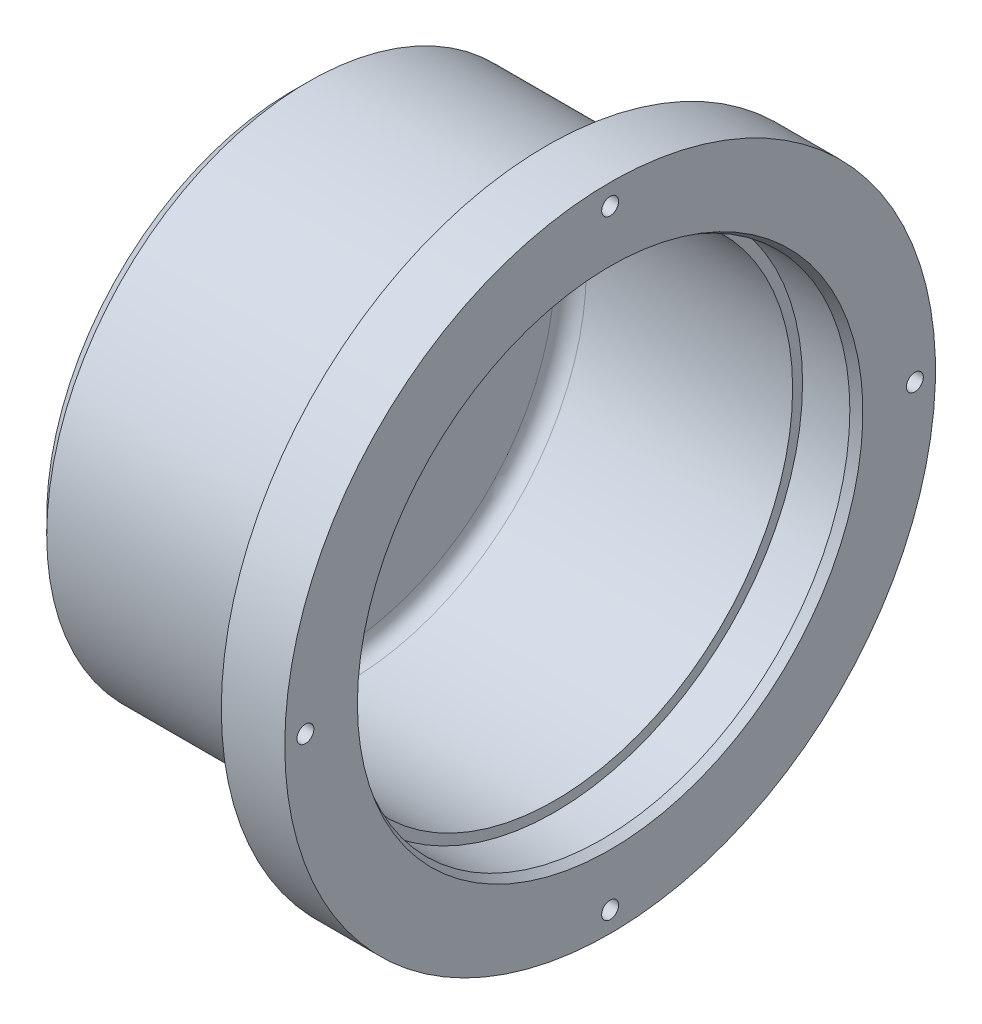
ISO-10303-21;
HEADER;
FILE_DESCRIPTION(('STEP AP214'),'2;1');
FILE_NAME('part.step','',(''),(''),'','','');
FILE_SCHEMA(('AUTOMOTIVE_DESIGN { 1 0 10303 214 1 1 1 1 }'));
ENDSEC;
DATA;
#1=APPLICATION_CONTEXT('core data for automotive mechanical design processes');
#2=APPLICATION_PROTOCOL_DEFINITION('international standard','automotive_design',2000,#1);
#3=PRODUCT_CONTEXT('',#1,'mechanical');
#4=PRODUCT('Part','Part','',(#3));
#5=PRODUCT_RELATED_PRODUCT_CATEGORY('part','',(#4));
#6=PRODUCT_DEFINITION_FORMATION('','',#4);
#7=PRODUCT_DEFINITION_CONTEXT('part definition',#1,'design');
#8=PRODUCT_DEFINITION('design','',#6,#7);
#9=PRODUCT_DEFINITION_SHAPE('','',#8);
#10=(LENGTH_UNIT() NAMED_UNIT(*) SI_UNIT(.MILLI.,.METRE.));
#11=(NAMED_UNIT(*) PLANE_ANGLE_UNIT() SI_UNIT($,.RADIAN.));
#12=(NAMED_UNIT(*) SI_UNIT($,.STERADIAN.) SOLID_ANGLE_UNIT());
#13=UNCERTAINTY_MEASURE_WITH_UNIT(LENGTH_MEASURE(1.E-05),#10,'distance_accuracy_value','');
#14=(GEOMETRIC_REPRESENTATION_CONTEXT(3) GLOBAL_UNCERTAINTY_ASSIGNED_CONTEXT((#13)) GLOBAL_UNIT_ASSIGNED_CONTEXT((#10,
#11,#12)) REPRESENTATION_CONTEXT('',''));
#15=CARTESIAN_POINT('',(0.,0.,0.));
#16=DIRECTION('',(0.,0.,1.));
#17=DIRECTION('',(1.,0.,0.));
#18=AXIS2_PLACEMENT_3D('',#15,#16,#17);
#19=CARTESIAN_POINT('',(-50.8,0.,0.));
#20=DIRECTION('',(-1.,0.,0.));
#21=DIRECTION('',(0.,0.,1.));
#22=AXIS2_PLACEMENT_3D('',#19,#20,#21);
#23=CYLINDRICAL_SURFACE('',#22,39.6875);
#24=CARTESIAN_POINT('',(-1.31982271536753,0.,0.));
#25=DIRECTION('',(-1.,0.,0.));
#26=DIRECTION('',(0.,0.,1.));
#27=AXIS2_PLACEMENT_3D('',#24,#25,#26);
#28=CIRCLE('',#27,39.6875);
#29=CARTESIAN_POINT('',(-1.31982271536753,0.,39.6875));
#30=VERTEX_POINT('',#29);
#31=EDGE_CURVE('E50',#30,#30,#28,.F.);
#32=ORIENTED_EDGE('',*,*,#31,.T.);
#33=EDGE_LOOP('',(#32));
#34=FACE_BOUND('',#33,.T.);
#35=CARTESIAN_POINT('',(-8.89000000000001,0.,0.));
#36=DIRECTION('',(-1.,0.,0.));
#37=DIRECTION('',(0.,0.,1.));
#38=AXIS2_PLACEMENT_3D('',#35,#36,#37);
#39=CIRCLE('',#38,39.6875);
#40=CARTESIAN_POINT('',(-8.89000000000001,0.,39.6875));
#41=VERTEX_POINT('',#40);
#42=EDGE_CURVE('E71',#41,#41,#39,.T.);
#43=ORIENTED_EDGE('',*,*,#42,.T.);
#44=EDGE_LOOP('',(#43));
#45=FACE_BOUND('',#44,.T.);
#46=ADVANCED_FACE('F31',(#34,#45),#23,.F.);
#47=CARTESIAN_POINT('',(0.,-31.4549673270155,0.));
#48=DIRECTION('',(-1.,0.,0.));
#49=DIRECTION('',(0.,0.,1.));
#50=AXIS2_PLACEMENT_3D('',#47,#48,#49);
#51=PLANE('',#50);
#52=CARTESIAN_POINT('',(0.,5.10817981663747E-13,48.768));
#53=DIRECTION('',(1.,0.,0.));
#54=DIRECTION('',(0.,0.,-1.));
#55=AXIS2_PLACEMENT_3D('',#52,#53,#54);
#56=CIRCLE('',#55,1.35254999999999);
#57=CARTESIAN_POINT('',(0.,5.10817981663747E-13,47.41545));
#58=VERTEX_POINT('',#57);
#59=EDGE_CURVE('E55',#58,#58,#56,.T.);
#60=ORIENTED_EDGE('',*,*,#59,.F.);
#61=EDGE_LOOP('',(#60));
#62=FACE_BOUND('',#61,.T.);
#63=CARTESIAN_POINT('',(0.,-48.768,3.40545321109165E-13));
#64=DIRECTION('',(1.,0.,0.));
#65=DIRECTION('',(0.,0.,-1.));
#66=AXIS2_PLACEMENT_3D('',#63,#64,#65);
#67=CIRCLE('',#66,1.35254999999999);
#68=CARTESIAN_POINT('',(0.,-48.768,-1.35254999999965));
#69=VERTEX_POINT('',#68);
#70=EDGE_CURVE('E54',#69,#69,#67,.T.);
#71=ORIENTED_EDGE('',*,*,#70,.F.);
#72=EDGE_LOOP('',(#71));
#73=FACE_BOUND('',#72,.T.);
#74=CARTESIAN_POINT('',(0.,-1.70272660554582E-13,-48.768));
#75=DIRECTION('',(1.,0.,0.));
#76=DIRECTION('',(0.,0.,-1.));
#77=AXIS2_PLACEMENT_3D('',#74,#75,#76);
#78=CIRCLE('',#77,1.35254999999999);
#79=CARTESIAN_POINT('',(0.,-1.70272660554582E-13,-50.12055));
#80=VERTEX_POINT('',#79);
#81=EDGE_CURVE('E59',#80,#80,#78,.T.);
#82=ORIENTED_EDGE('',*,*,#81,.F.);
#83=EDGE_LOOP('',(#82));
#84=FACE_BOUND('',#83,.T.);
#85=CARTESIAN_POINT('',(0.,48.768,0.));
#86=DIRECTION('',(1.,0.,0.));
#87=DIRECTION('',(0.,0.,-1.));
#88=AXIS2_PLACEMENT_3D('',#85,#86,#87);
#89=CIRCLE('',#88,1.35254999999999);
#90=CARTESIAN_POINT('',(0.,48.768,-1.35254999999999));
#91=VERTEX_POINT('',#90);
#92=EDGE_CURVE('E63',#91,#91,#89,.T.);
#93=ORIENTED_EDGE('',*,*,#92,.F.);
#94=EDGE_LOOP('',(#93));
#95=FACE_BOUND('',#94,.T.);
#96=CARTESIAN_POINT('',(0.,0.,0.));
#97=DIRECTION('',(-1.,0.,0.));
#98=DIRECTION('',(0.,0.,1.));
#99=AXIS2_PLACEMENT_3D('',#96,#97,#98);
#100=CIRCLE('',#99,40.4495);
#101=CARTESIAN_POINT('',(0.,0.,40.4495));
#102=VERTEX_POINT('',#101);
#103=EDGE_CURVE('E74',#102,#102,#100,.T.);
#104=ORIENTED_EDGE('',*,*,#103,.T.);
#105=EDGE_LOOP('',(#104));
#106=FACE_BOUND('',#105,.T.);
#107=CARTESIAN_POINT('',(0.,0.,0.));
#108=DIRECTION('',(-1.,0.,0.));
#109=DIRECTION('',(0.,0.,1.));
#110=AXIS2_PLACEMENT_3D('',#107,#108,#109);
#111=CIRCLE('',#110,52.07);
#112=CARTESIAN_POINT('',(0.,0.,52.07));
#113=VERTEX_POINT('',#112);
#114=EDGE_CURVE('E83',#113,#113,#111,.T.);
#115=ORIENTED_EDGE('',*,*,#114,.F.);
#116=EDGE_LOOP('',(#115));
#117=FACE_BOUND('',#116,.T.);
#118=ADVANCED_FACE('F108',(#62,#73,#84,#95,#106,#117),#51,.F.);
#119=CARTESIAN_POINT('',(-50.8,0.,0.));
#120=DIRECTION('',(-1.,0.,0.));
#121=DIRECTION('',(0.,0.,1.));
#122=AXIS2_PLACEMENT_3D('',#119,#120,#121);
#123=CYLINDRICAL_SURFACE('',#122,52.07);
#124=CARTESIAN_POINT('',(-10.16,0.,0.));
#125=DIRECTION('',(-1.,0.,0.));
#126=DIRECTION('',(0.,0.,1.));
#127=AXIS2_PLACEMENT_3D('',#124,#125,#126);
#128=CIRCLE('',#127,52.07);
#129=CARTESIAN_POINT('',(-10.16,0.,52.07));
#130=VERTEX_POINT('',#129);
#131=EDGE_CURVE('E86',#130,#130,#128,.T.);
#132=ORIENTED_EDGE('',*,*,#131,.F.);
#133=EDGE_LOOP('',(#132));
#134=FACE_BOUND('',#133,.T.);
#135=ORIENTED_EDGE('',*,*,#114,.T.);
#136=EDGE_LOOP('',(#135));
#137=FACE_BOUND('',#136,.T.);
#138=ADVANCED_FACE('F111',(#134,#137),#123,.T.);
#139=CARTESIAN_POINT('',(-10.16,-31.4549673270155,0.));
#140=DIRECTION('',(1.,0.,0.));
#141=DIRECTION('',(0.,0.,-1.));
#142=AXIS2_PLACEMENT_3D('',#139,#140,#141);
#143=PLANE('',#142);
#144=CARTESIAN_POINT('',(-10.16,0.,0.));
#145=DIRECTION('',(1.,0.,0.));
#146=DIRECTION('',(0.,0.,-1.));
#147=AXIS2_PLACEMENT_3D('',#144,#145,#146);
#148=CIRCLE('',#147,43.18);
#149=CARTESIAN_POINT('',(-10.16,0.,-43.18));
#150=VERTEX_POINT('',#149);
#151=EDGE_CURVE('E41',#150,#150,#148,.T.);
#152=ORIENTED_EDGE('',*,*,#151,.T.);
#153=EDGE_LOOP('',(#152));
#154=FACE_BOUND('',#153,.T.);
#155=CARTESIAN_POINT('',(-10.16,5.10817981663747E-13,48.768));
#156=DIRECTION('',(1.,0.,0.));
#157=DIRECTION('',(0.,0.,-1.));
#158=AXIS2_PLACEMENT_3D('',#155,#156,#157);
#159=CIRCLE('',#158,1.35254999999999);
#160=CARTESIAN_POINT('',(-10.16,5.10817981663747E-13,47.41545));
#161=VERTEX_POINT('',#160);
#162=EDGE_CURVE('E51',#161,#161,#159,.T.);
#163=ORIENTED_EDGE('',*,*,#162,.T.);
#164=EDGE_LOOP('',(#163));
#165=FACE_BOUND('',#164,.T.);
#166=CARTESIAN_POINT('',(-10.16,-48.768,3.40545321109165E-13));
#167=DIRECTION('',(1.,0.,0.));
#168=DIRECTION('',(0.,0.,-1.));
#169=AXIS2_PLACEMENT_3D('',#166,#167,#168);
#170=CIRCLE('',#169,1.35254999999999);
#171=CARTESIAN_POINT('',(-10.16,-48.768,-1.35254999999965));
#172=VERTEX_POINT('',#171);
#173=EDGE_CURVE('E56',#172,#172,#170,.T.);
#174=ORIENTED_EDGE('',*,*,#173,.T.);
#175=EDGE_LOOP('',(#174));
#176=FACE_BOUND('',#175,.T.);
#177=CARTESIAN_POINT('',(-10.16,-1.70272660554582E-13,-48.768));
#178=DIRECTION('',(1.,0.,0.));
#179=DIRECTION('',(0.,0.,-1.));
#180=AXIS2_PLACEMENT_3D('',#177,#178,#179);
#181=CIRCLE('',#180,1.35254999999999);
#182=CARTESIAN_POINT('',(-10.16,-1.70272660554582E-13,-50.12055));
#183=VERTEX_POINT('',#182);
#184=EDGE_CURVE('E60',#183,#183,#181,.T.);
#185=ORIENTED_EDGE('',*,*,#184,.T.);
#186=EDGE_LOOP('',(#185));
#187=FACE_BOUND('',#186,.T.);
#188=CARTESIAN_POINT('',(-10.16,48.768,0.));
#189=DIRECTION('',(1.,0.,0.));
#190=DIRECTION('',(0.,0.,-1.));
#191=AXIS2_PLACEMENT_3D('',#188,#189,#190);
#192=CIRCLE('',#191,1.35254999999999);
#193=CARTESIAN_POINT('',(-10.16,48.768,-1.35254999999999));
#194=VERTEX_POINT('',#193);
#195=EDGE_CURVE('E64',#194,#194,#192,.T.);
#196=ORIENTED_EDGE('',*,*,#195,.T.);
#197=EDGE_LOOP('',(#196));
#198=FACE_BOUND('',#197,.T.);
#199=ORIENTED_EDGE('',*,*,#131,.T.);
#200=EDGE_LOOP('',(#199));
#201=FACE_BOUND('',#200,.T.);
#202=ADVANCED_FACE('F123',(#154,#165,#176,#187,#198,#201),#143,.F.);
#203=CARTESIAN_POINT('',(-50.8,0.,0.));
#204=DIRECTION('',(-1.,0.,0.));
#205=DIRECTION('',(0.,0.,1.));
#206=AXIS2_PLACEMENT_3D('',#203,#204,#205);
#207=CYLINDRICAL_SURFACE('',#206,41.91);
#208=CARTESIAN_POINT('',(-11.43,0.,0.));
#209=DIRECTION('',(1.,0.,0.));
#210=DIRECTION('',(0.,0.,-1.));
#211=AXIS2_PLACEMENT_3D('',#208,#209,#210);
#212=CIRCLE('',#211,41.91);
#213=CARTESIAN_POINT('',(-11.43,0.,-41.91));
#214=VERTEX_POINT('',#213);
#215=EDGE_CURVE('E45',#214,#214,#212,.F.);
#216=ORIENTED_EDGE('',*,*,#215,.T.);
#217=EDGE_LOOP('',(#216));
#218=FACE_BOUND('',#217,.T.);
#219=CARTESIAN_POINT('',(-48.26,0.,0.));
#220=DIRECTION('',(1.,0.,0.));
#221=DIRECTION('',(0.,0.,-1.));
#222=AXIS2_PLACEMENT_3D('',#219,#220,#221);
#223=CIRCLE('',#222,41.91);
#224=CARTESIAN_POINT('',(-48.26,0.,-41.91));
#225=VERTEX_POINT('',#224);
#226=EDGE_CURVE('E77',#225,#225,#223,.T.);
#227=ORIENTED_EDGE('',*,*,#226,.T.);
#228=EDGE_LOOP('',(#227));
#229=FACE_BOUND('',#228,.T.);
#230=ADVANCED_FACE('F129',(#218,#229),#207,.T.);
#231=CARTESIAN_POINT('',(-50.8,-31.4549673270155,0.));
#232=DIRECTION('',(1.,0.,0.));
#233=DIRECTION('',(0.,0.,-1.));
#234=AXIS2_PLACEMENT_3D('',#231,#232,#233);
#235=PLANE('',#234);
#236=CARTESIAN_POINT('',(-50.8,0.,0.));
#237=DIRECTION('',(-1.,0.,0.));
#238=DIRECTION('',(0.,0.,1.));
#239=AXIS2_PLACEMENT_3D('',#236,#237,#238);
#240=CIRCLE('',#239,9.8827971);
#241=CARTESIAN_POINT('',(-50.8,0.,9.8827971));
#242=VERTEX_POINT('',#241);
#243=EDGE_CURVE('E67',#242,#242,#240,.T.);
#244=ORIENTED_EDGE('',*,*,#243,.F.);
#245=EDGE_LOOP('',(#244));
#246=FACE_BOUND('',#245,.T.);
#247=CARTESIAN_POINT('',(-50.8,0.,0.));
#248=DIRECTION('',(1.,0.,0.));
#249=DIRECTION('',(0.,0.,-1.));
#250=AXIS2_PLACEMENT_3D('',#247,#248,#249);
#251=CIRCLE('',#250,39.37);
#252=CARTESIAN_POINT('',(-50.8,0.,-39.37));
#253=VERTEX_POINT('',#252);
#254=EDGE_CURVE('E80',#253,#253,#251,.F.);
#255=ORIENTED_EDGE('',*,*,#254,.T.);
#256=EDGE_LOOP('',(#255));
#257=FACE_BOUND('',#256,.T.);
#258=ADVANCED_FACE('F155',(#246,#257),#235,.F.);
#259=CARTESIAN_POINT('',(-44.45,-31.4549673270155,0.));
#260=DIRECTION('',(-1.,0.,0.));
#261=DIRECTION('',(0.,0.,1.));
#262=AXIS2_PLACEMENT_3D('',#259,#260,#261);
#263=PLANE('',#262);
#264=CARTESIAN_POINT('',(-44.45,0.,0.));
#265=DIRECTION('',(-1.,0.,0.));
#266=DIRECTION('',(0.,0.,1.));
#267=AXIS2_PLACEMENT_3D('',#264,#265,#266);
#268=CIRCLE('',#267,35.56);
#269=CARTESIAN_POINT('',(-44.45,0.,35.56));
#270=VERTEX_POINT('',#269);
#271=EDGE_CURVE('E10',#270,#270,#268,.F.);
#272=ORIENTED_EDGE('',*,*,#271,.T.);
#273=EDGE_LOOP('',(#272));
#274=FACE_BOUND('',#273,.T.);
#275=CARTESIAN_POINT('',(-44.45,0.,0.));
#276=DIRECTION('',(-1.,0.,0.));
#277=DIRECTION('',(0.,0.,1.));
#278=AXIS2_PLACEMENT_3D('',#275,#276,#277);
#279=CIRCLE('',#278,9.69266959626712);
#280=CARTESIAN_POINT('',(-44.45,0.,9.69266959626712));
#281=VERTEX_POINT('',#280);
#282=EDGE_CURVE('E68',#281,#281,#279,.T.);
#283=ORIENTED_EDGE('',*,*,#282,.T.);
#284=EDGE_LOOP('',(#283));
#285=FACE_BOUND('',#284,.T.);
#286=ADVANCED_FACE('F150',(#274,#285),#263,.F.);
#287=CARTESIAN_POINT('',(-50.8,0.,0.));
#288=DIRECTION('',(-1.,0.,0.));
#289=DIRECTION('',(0.,0.,1.));
#290=AXIS2_PLACEMENT_3D('',#287,#288,#289);
#291=CYLINDRICAL_SURFACE('',#290,38.1);
#292=CARTESIAN_POINT('',(-41.91,0.,0.));
#293=DIRECTION('',(-1.,0.,0.));
#294=DIRECTION('',(0.,0.,1.));
#295=AXIS2_PLACEMENT_3D('',#292,#293,#294);
#296=CIRCLE('',#295,38.1);
#297=CARTESIAN_POINT('',(-41.91,0.,38.1));
#298=VERTEX_POINT('',#297);
#299=EDGE_CURVE('E37',#298,#298,#296,.T.);
#300=ORIENTED_EDGE('',*,*,#299,.T.);
#301=EDGE_LOOP('',(#300));
#302=FACE_BOUND('',#301,.T.);
#303=CARTESIAN_POINT('',(-8.89000000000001,0.,0.));
#304=DIRECTION('',(-1.,0.,0.));
#305=DIRECTION('',(0.,0.,1.));
#306=AXIS2_PLACEMENT_3D('',#303,#304,#305);
#307=CIRCLE('',#306,38.1);
#308=CARTESIAN_POINT('',(-8.89000000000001,0.,38.1));
#309=VERTEX_POINT('',#308);
#310=EDGE_CURVE('E89',#309,#309,#307,.T.);
#311=ORIENTED_EDGE('',*,*,#310,.F.);
#312=EDGE_LOOP('',(#311));
#313=FACE_BOUND('',#312,.T.);
#314=ADVANCED_FACE('F145',(#302,#313),#291,.F.);
#315=CARTESIAN_POINT('',(-8.89000000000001,-31.4549673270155,0.));
#316=DIRECTION('',(-1.,0.,0.));
#317=DIRECTION('',(0.,0.,1.));
#318=AXIS2_PLACEMENT_3D('',#315,#316,#317);
#319=PLANE('',#318);
#320=ORIENTED_EDGE('',*,*,#42,.F.);
#321=EDGE_LOOP('',(#320));
#322=FACE_BOUND('',#321,.T.);
#323=ORIENTED_EDGE('',*,*,#310,.T.);
#324=EDGE_LOOP('',(#323));
#325=FACE_BOUND('',#324,.T.);
#326=ADVANCED_FACE('F141',(#322,#325),#319,.F.);
#327=CARTESIAN_POINT('',(-50.8,0.,0.));
#328=DIRECTION('',(1.,0.,0.));
#329=DIRECTION('',(0.,0.,-1.));
#330=AXIS2_PLACEMENT_3D('',#327,#328,#329);
#331=CONICAL_SURFACE('',#330,39.37,0.785398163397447);
#332=ORIENTED_EDGE('',*,*,#226,.F.);
#333=EDGE_LOOP('',(#332));
#334=FACE_BOUND('',#333,.T.);
#335=ORIENTED_EDGE('',*,*,#254,.F.);
#336=EDGE_LOOP('',(#335));
#337=FACE_BOUND('',#336,.T.);
#338=ADVANCED_FACE('F144',(#334,#337),#331,.T.);
#339=CARTESIAN_POINT('',(0.,0.,0.));
#340=DIRECTION('',(1.,0.,0.));
#341=DIRECTION('',(0.,0.,-1.));
#342=AXIS2_PLACEMENT_3D('',#339,#340,#341);
#343=CONICAL_SURFACE('',#342,40.4495,0.5235987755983);
#344=ORIENTED_EDGE('',*,*,#31,.F.);
#345=EDGE_LOOP('',(#344));
#346=FACE_BOUND('',#345,.T.);
#347=ORIENTED_EDGE('',*,*,#103,.F.);
#348=EDGE_LOOP('',(#347));
#349=FACE_BOUND('',#348,.T.);
#350=ADVANCED_FACE('F172',(#346,#349),#343,.F.);
#351=CARTESIAN_POINT('',(-50.8,0.,0.));
#352=DIRECTION('',(-1.,0.,0.));
#353=DIRECTION('',(0.,0.,1.));
#354=AXIS2_PLACEMENT_3D('',#351,#352,#353);
#355=CONICAL_SURFACE('',#354,9.8827971,0.0299323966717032);
#356=ORIENTED_EDGE('',*,*,#243,.T.);
#357=EDGE_LOOP('',(#356));
#358=FACE_BOUND('',#357,.T.);
#359=ORIENTED_EDGE('',*,*,#282,.F.);
#360=EDGE_LOOP('',(#359));
#361=FACE_BOUND('',#360,.T.);
#362=ADVANCED_FACE('F178',(#358,#361),#355,.F.);
#363=CARTESIAN_POINT('',(0.,48.768,0.));
#364=DIRECTION('',(1.,0.,0.));
#365=DIRECTION('',(0.,0.,-1.));
#366=AXIS2_PLACEMENT_3D('',#363,#364,#365);
#367=CYLINDRICAL_SURFACE('',#366,1.35254999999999);
#368=ORIENTED_EDGE('',*,*,#92,.T.);
#369=EDGE_LOOP('',(#368));
#370=FACE_BOUND('',#369,.T.);
#371=ORIENTED_EDGE('',*,*,#195,.F.);
#372=EDGE_LOOP('',(#371));
#373=FACE_BOUND('',#372,.T.);
#374=ADVANCED_FACE('F184',(#370,#373),#367,.F.);
#375=CARTESIAN_POINT('',(0.,-1.70272660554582E-13,-48.768));
#376=DIRECTION('',(1.,0.,0.));
#377=DIRECTION('',(0.,0.,-1.));
#378=AXIS2_PLACEMENT_3D('',#375,#376,#377);
#379=CYLINDRICAL_SURFACE('',#378,1.35254999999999);
#380=ORIENTED_EDGE('',*,*,#81,.T.);
#381=EDGE_LOOP('',(#380));
#382=FACE_BOUND('',#381,.T.);
#383=ORIENTED_EDGE('',*,*,#184,.F.);
#384=EDGE_LOOP('',(#383));
#385=FACE_BOUND('',#384,.T.);
#386=ADVANCED_FACE('F188',(#382,#385),#379,.F.);
#387=CARTESIAN_POINT('',(0.,-48.768,3.40545321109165E-13));
#388=DIRECTION('',(1.,0.,0.));
#389=DIRECTION('',(0.,0.,-1.));
#390=AXIS2_PLACEMENT_3D('',#387,#388,#389);
#391=CYLINDRICAL_SURFACE('',#390,1.35254999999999);
#392=ORIENTED_EDGE('',*,*,#70,.T.);
#393=EDGE_LOOP('',(#392));
#394=FACE_BOUND('',#393,.T.);
#395=ORIENTED_EDGE('',*,*,#173,.F.);
#396=EDGE_LOOP('',(#395));
#397=FACE_BOUND('',#396,.T.);
#398=ADVANCED_FACE('F192',(#394,#397),#391,.F.);
#399=CARTESIAN_POINT('',(0.,5.10817981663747E-13,48.768));
#400=DIRECTION('',(1.,0.,0.));
#401=DIRECTION('',(0.,0.,-1.));
#402=AXIS2_PLACEMENT_3D('',#399,#400,#401);
#403=CYLINDRICAL_SURFACE('',#402,1.35254999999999);
#404=ORIENTED_EDGE('',*,*,#59,.T.);
#405=EDGE_LOOP('',(#404));
#406=FACE_BOUND('',#405,.T.);
#407=ORIENTED_EDGE('',*,*,#162,.F.);
#408=EDGE_LOOP('',(#407));
#409=FACE_BOUND('',#408,.T.);
#410=ADVANCED_FACE('F105',(#406,#409),#403,.F.);
#411=CARTESIAN_POINT('',(-11.43,0.,0.));
#412=DIRECTION('',(1.,0.,0.));
#413=DIRECTION('',(0.,0.,-1.));
#414=AXIS2_PLACEMENT_3D('',#411,#412,#413);
#415=TOROIDAL_SURFACE('',#414,43.18,1.27);
#416=ORIENTED_EDGE('',*,*,#151,.F.);
#417=EDGE_LOOP('',(#416));
#418=FACE_BOUND('',#417,.T.);
#419=ORIENTED_EDGE('',*,*,#215,.F.);
#420=EDGE_LOOP('',(#419));
#421=FACE_BOUND('',#420,.T.);
#422=ADVANCED_FACE('F199',(#418,#421),#415,.F.);
#423=CARTESIAN_POINT('',(-41.91,0.,0.));
#424=DIRECTION('',(-1.,0.,0.));
#425=DIRECTION('',(0.,0.,1.));
#426=AXIS2_PLACEMENT_3D('',#423,#424,#425);
#427=TOROIDAL_SURFACE('',#426,35.56,2.54);
#428=ORIENTED_EDGE('',*,*,#271,.F.);
#429=EDGE_LOOP('',(#428));
#430=FACE_BOUND('',#429,.T.);
#431=ORIENTED_EDGE('',*,*,#299,.F.);
#432=EDGE_LOOP('',(#431));
#433=FACE_BOUND('',#432,.T.);
#434=ADVANCED_FACE('F202',(#430,#433),#427,.F.);
#435=CLOSED_SHELL('',(#46,#118,#138,#202,#230,#258,#286,#314,#326,#338,#350,#362,#374,#386,#398,
#410,#422,#434));
#436=MANIFOLD_SOLID_BREP('B2',#435);
#437=ADVANCED_BREP_SHAPE_REPRESENTATION('',(#18,#436),#14);
#438=SHAPE_DEFINITION_REPRESENTATION(#9,#437);
ENDSEC;
END-ISO-10303-21;
